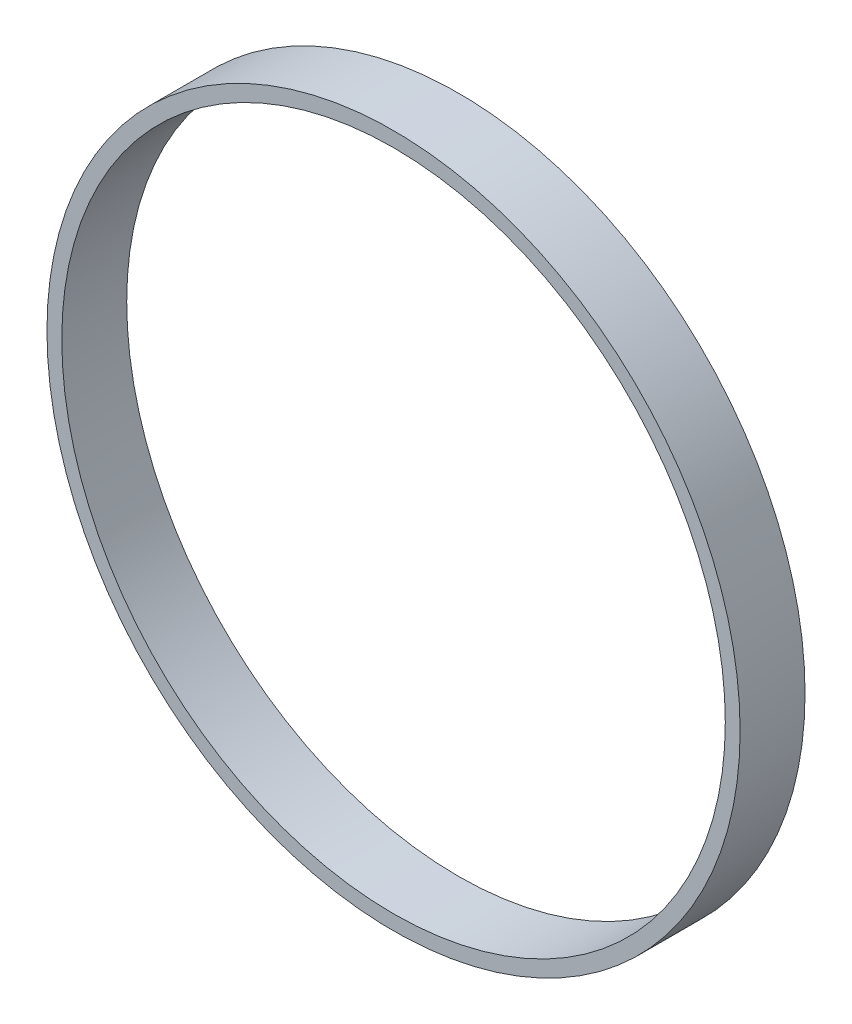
ISO-10303-21;
HEADER;
FILE_DESCRIPTION(('STEP AP214'),'2;1');
FILE_NAME('part.step','',(''),(''),'','','');
FILE_SCHEMA(('AUTOMOTIVE_DESIGN { 1 0 10303 214 1 1 1 1 }'));
ENDSEC;
DATA;
#1=APPLICATION_CONTEXT('core data for automotive mechanical design processes');
#2=APPLICATION_PROTOCOL_DEFINITION('international standard','automotive_design',2000,#1);
#3=PRODUCT_CONTEXT('',#1,'mechanical');
#4=PRODUCT('Part','Part','',(#3));
#5=PRODUCT_RELATED_PRODUCT_CATEGORY('part','',(#4));
#6=PRODUCT_DEFINITION_FORMATION('','',#4);
#7=PRODUCT_DEFINITION_CONTEXT('part definition',#1,'design');
#8=PRODUCT_DEFINITION('design','',#6,#7);
#9=PRODUCT_DEFINITION_SHAPE('','',#8);
#10=(LENGTH_UNIT() NAMED_UNIT(*) SI_UNIT(.MILLI.,.METRE.));
#11=(NAMED_UNIT(*) PLANE_ANGLE_UNIT() SI_UNIT($,.RADIAN.));
#12=(NAMED_UNIT(*) SI_UNIT($,.STERADIAN.) SOLID_ANGLE_UNIT());
#13=UNCERTAINTY_MEASURE_WITH_UNIT(LENGTH_MEASURE(1.E-05),#10,'distance_accuracy_value','');
#14=(GEOMETRIC_REPRESENTATION_CONTEXT(3) GLOBAL_UNCERTAINTY_ASSIGNED_CONTEXT((#13)) GLOBAL_UNIT_ASSIGNED_CONTEXT((#10,
#11,#12)) REPRESENTATION_CONTEXT('',''));
#15=CARTESIAN_POINT('',(0.,0.,0.));
#16=DIRECTION('',(0.,0.,1.));
#17=DIRECTION('',(1.,0.,0.));
#18=AXIS2_PLACEMENT_3D('',#15,#16,#17);
#19=CARTESIAN_POINT('',(0.,0.,12.7));
#20=DIRECTION('',(0.,0.,1.));
#21=DIRECTION('',(1.,0.,0.));
#22=AXIS2_PLACEMENT_3D('',#19,#20,#21);
#23=PLANE('',#22);
#24=CARTESIAN_POINT('',(0.,0.,12.7));
#25=DIRECTION('',(0.,0.,1.));
#26=DIRECTION('',(1.,0.,0.));
#27=AXIS2_PLACEMENT_3D('',#24,#25,#26);
#28=CIRCLE('',#27,67.8);
#29=CARTESIAN_POINT('',(67.8,0.,12.7));
#30=VERTEX_POINT('',#29);
#31=EDGE_CURVE('E8',#30,#30,#28,.T.);
#32=ORIENTED_EDGE('',*,*,#31,.T.);
#33=EDGE_LOOP('',(#32));
#34=FACE_BOUND('',#33,.T.);
#35=CARTESIAN_POINT('',(0.,0.,12.7));
#36=DIRECTION('',(0.,0.,1.));
#37=DIRECTION('',(1.,0.,0.));
#38=AXIS2_PLACEMENT_3D('',#35,#36,#37);
#39=CIRCLE('',#38,64.9);
#40=CARTESIAN_POINT('',(64.9,0.,12.7));
#41=VERTEX_POINT('',#40);
#42=EDGE_CURVE('E23',#41,#41,#39,.T.);
#43=ORIENTED_EDGE('',*,*,#42,.F.);
#44=EDGE_LOOP('',(#43));
#45=FACE_BOUND('',#44,.T.);
#46=ADVANCED_FACE('F12',(#34,#45),#23,.T.);
#47=CARTESIAN_POINT('',(0.,0.,0.));
#48=DIRECTION('',(0.,0.,1.));
#49=DIRECTION('',(1.,0.,0.));
#50=AXIS2_PLACEMENT_3D('',#47,#48,#49);
#51=PLANE('',#50);
#52=CARTESIAN_POINT('',(0.,0.,0.));
#53=DIRECTION('',(0.,0.,1.));
#54=DIRECTION('',(1.,0.,0.));
#55=AXIS2_PLACEMENT_3D('',#52,#53,#54);
#56=CIRCLE('',#55,67.8);
#57=CARTESIAN_POINT('',(67.8,0.,0.));
#58=VERTEX_POINT('',#57);
#59=EDGE_CURVE('E16',#58,#58,#56,.T.);
#60=ORIENTED_EDGE('',*,*,#59,.F.);
#61=EDGE_LOOP('',(#60));
#62=FACE_BOUND('',#61,.T.);
#63=CARTESIAN_POINT('',(0.,0.,0.));
#64=DIRECTION('',(0.,0.,1.));
#65=DIRECTION('',(1.,0.,0.));
#66=AXIS2_PLACEMENT_3D('',#63,#64,#65);
#67=CIRCLE('',#66,64.9);
#68=CARTESIAN_POINT('',(64.9,0.,0.));
#69=VERTEX_POINT('',#68);
#70=EDGE_CURVE('E25',#69,#69,#67,.T.);
#71=ORIENTED_EDGE('',*,*,#70,.T.);
#72=EDGE_LOOP('',(#71));
#73=FACE_BOUND('',#72,.T.);
#74=ADVANCED_FACE('F35',(#62,#73),#51,.F.);
#75=CARTESIAN_POINT('',(0.,0.,12.7));
#76=DIRECTION('',(0.,0.,-1.));
#77=DIRECTION('',(-1.,0.,0.));
#78=AXIS2_PLACEMENT_3D('',#75,#76,#77);
#79=CYLINDRICAL_SURFACE('',#78,67.8);
#80=ORIENTED_EDGE('',*,*,#31,.F.);
#81=EDGE_LOOP('',(#80));
#82=FACE_BOUND('',#81,.T.);
#83=ORIENTED_EDGE('',*,*,#59,.T.);
#84=EDGE_LOOP('',(#83));
#85=FACE_BOUND('',#84,.T.);
#86=ADVANCED_FACE('F14',(#82,#85),#79,.T.);
#87=CARTESIAN_POINT('',(0.,0.,12.7));
#88=DIRECTION('',(0.,0.,-1.));
#89=DIRECTION('',(-1.,0.,0.));
#90=AXIS2_PLACEMENT_3D('',#87,#88,#89);
#91=CYLINDRICAL_SURFACE('',#90,64.9);
#92=ORIENTED_EDGE('',*,*,#42,.T.);
#93=EDGE_LOOP('',(#92));
#94=FACE_BOUND('',#93,.T.);
#95=ORIENTED_EDGE('',*,*,#70,.F.);
#96=EDGE_LOOP('',(#95));
#97=FACE_BOUND('',#96,.T.);
#98=ADVANCED_FACE('F31',(#94,#97),#91,.F.);
#99=CLOSED_SHELL('',(#46,#74,#86,#98));
#100=MANIFOLD_SOLID_BREP('B1',#99);
#101=ADVANCED_BREP_SHAPE_REPRESENTATION('',(#18,#100),#14);
#102=SHAPE_DEFINITION_REPRESENTATION(#9,#101);
ENDSEC;
END-ISO-10303-21;
